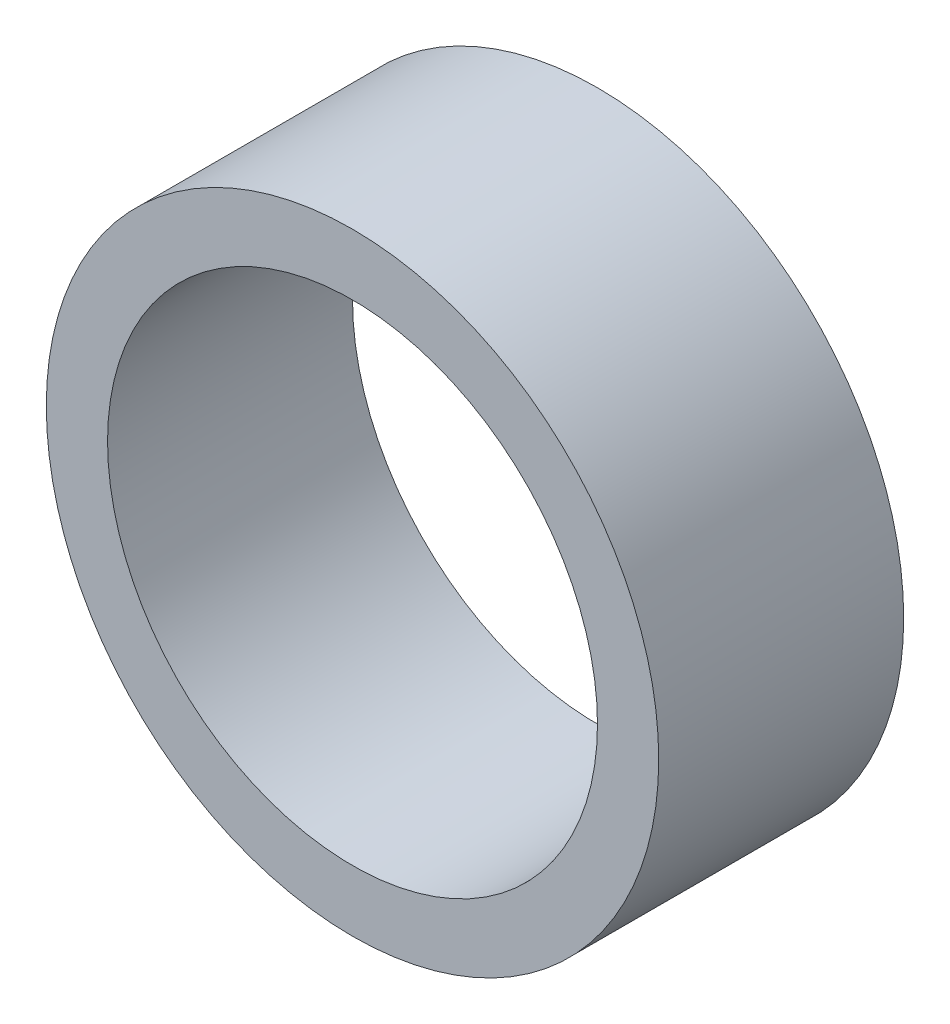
from build123d import *

# Parameters (mm, degrees)
SKETCH1_R      = 25
SKETCH1_R_2    = 20
EXTRUDE1_DEPTH = 20


with BuildPart() as part:
    # Sketch1 → Extrude1 (new body)
    with BuildSketch(Plane.XY):
        Circle(SKETCH1_R)
        Circle(SKETCH1_R_2, mode=Mode.SUBTRACT)
    extrude(amount=EXTRUDE1_DEPTH)


solid = part.part
